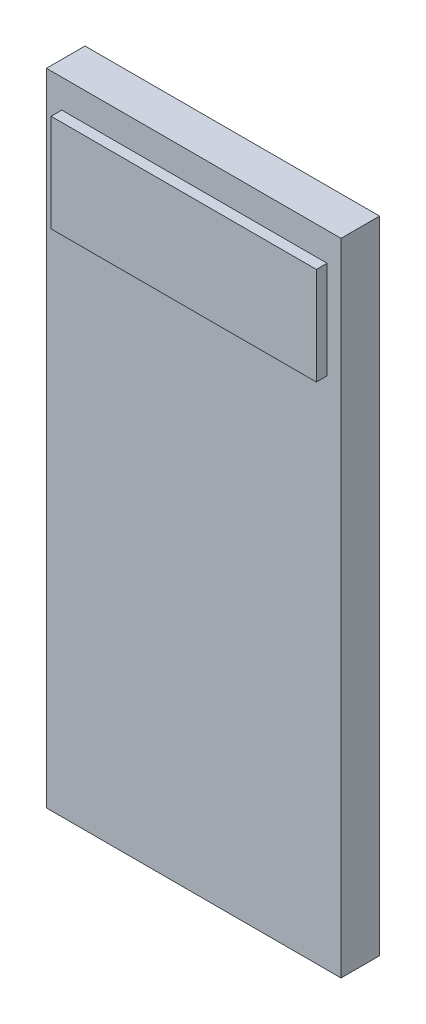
ISO-10303-21;
HEADER;
FILE_DESCRIPTION(('STEP AP214'),'2;1');
FILE_NAME('part.step','',(''),(''),'','','');
FILE_SCHEMA(('AUTOMOTIVE_DESIGN { 1 0 10303 214 1 1 1 1 }'));
ENDSEC;
DATA;
#1=APPLICATION_CONTEXT('core data for automotive mechanical design processes');
#2=APPLICATION_PROTOCOL_DEFINITION('international standard','automotive_design',2000,#1);
#3=PRODUCT_CONTEXT('',#1,'mechanical');
#4=PRODUCT('Part','Part','',(#3));
#5=PRODUCT_RELATED_PRODUCT_CATEGORY('part','',(#4));
#6=PRODUCT_DEFINITION_FORMATION('','',#4);
#7=PRODUCT_DEFINITION_CONTEXT('part definition',#1,'design');
#8=PRODUCT_DEFINITION('design','',#6,#7);
#9=PRODUCT_DEFINITION_SHAPE('','',#8);
#10=(LENGTH_UNIT() NAMED_UNIT(*) SI_UNIT(.MILLI.,.METRE.));
#11=(NAMED_UNIT(*) PLANE_ANGLE_UNIT() SI_UNIT($,.RADIAN.));
#12=(NAMED_UNIT(*) SI_UNIT($,.STERADIAN.) SOLID_ANGLE_UNIT());
#13=UNCERTAINTY_MEASURE_WITH_UNIT(LENGTH_MEASURE(1.E-05),#10,'distance_accuracy_value','');
#14=(GEOMETRIC_REPRESENTATION_CONTEXT(3) GLOBAL_UNCERTAINTY_ASSIGNED_CONTEXT((#13)) GLOBAL_UNIT_ASSIGNED_CONTEXT((#10,
#11,#12)) REPRESENTATION_CONTEXT('',''));
#15=CARTESIAN_POINT('',(0.,0.,0.));
#16=DIRECTION('',(0.,0.,1.));
#17=DIRECTION('',(1.,0.,0.));
#18=AXIS2_PLACEMENT_3D('',#15,#16,#17);
#19=CARTESIAN_POINT('',(10.7,0.,1.8));
#20=DIRECTION('',(0.,0.,-1.));
#21=DIRECTION('',(-1.,0.,0.));
#22=AXIS2_PLACEMENT_3D('',#19,#20,#21);
#23=PLANE('',#22);
#24=DIRECTION('',(0.,1.,0.));
#25=VECTOR('',#24,1.);
#26=CARTESIAN_POINT('',(-6.89999999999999,16.85,1.8));
#27=LINE('',#26,#25);
#28=CARTESIAN_POINT('',(-6.89999999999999,16.85,1.8));
#29=VERTEX_POINT('',#28);
#30=CARTESIAN_POINT('',(-6.89999999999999,46.75,1.8));
#31=VERTEX_POINT('',#30);
#32=EDGE_CURVE('E39',#29,#31,#27,.T.);
#33=ORIENTED_EDGE('',*,*,#32,.F.);
#34=DIRECTION('',(-1.,0.,0.));
#35=VECTOR('',#34,1.);
#36=CARTESIAN_POINT('',(6.84999999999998,16.85,1.8));
#37=LINE('',#36,#35);
#38=CARTESIAN_POINT('',(6.84999999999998,16.85,1.8));
#39=VERTEX_POINT('',#38);
#40=EDGE_CURVE('E126',#39,#29,#37,.T.);
#41=ORIENTED_EDGE('',*,*,#40,.F.);
#42=DIRECTION('',(0.,-1.,0.));
#43=VECTOR('',#42,1.);
#44=CARTESIAN_POINT('',(6.84999999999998,46.75,1.8));
#45=LINE('',#44,#43);
#46=CARTESIAN_POINT('',(6.84999999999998,46.75,1.8));
#47=VERTEX_POINT('',#46);
#48=EDGE_CURVE('E34',#47,#39,#45,.T.);
#49=ORIENTED_EDGE('',*,*,#48,.F.);
#50=DIRECTION('',(1.,0.,0.));
#51=VECTOR('',#50,1.);
#52=CARTESIAN_POINT('',(6.84999999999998,46.75,1.8));
#53=LINE('',#52,#51);
#54=EDGE_CURVE('E11',#31,#47,#53,.T.);
#55=ORIENTED_EDGE('',*,*,#54,.F.);
#56=EDGE_LOOP('',(#33,#41,#49,#55));
#57=FACE_BOUND('',#56,.T.);
#58=DIRECTION('',(0.,-1.,0.));
#59=VECTOR('',#58,1.);
#60=CARTESIAN_POINT('',(-6.1836979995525,45.4179345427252,1.8));
#61=LINE('',#60,#59);
#62=CARTESIAN_POINT('',(-6.1836979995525,45.4179345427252,1.8));
#63=VERTEX_POINT('',#62);
#64=CARTESIAN_POINT('',(-6.1836979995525,40.8666413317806,1.8));
#65=VERTEX_POINT('',#64);
#66=EDGE_CURVE('E93',#63,#65,#61,.T.);
#67=ORIENTED_EDGE('',*,*,#66,.F.);
#68=DIRECTION('',(-1.,0.,0.));
#69=VECTOR('',#68,1.);
#70=CARTESIAN_POINT('',(-6.1836979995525,45.4179345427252,1.8));
#71=LINE('',#70,#69);
#72=CARTESIAN_POINT('',(6.19953164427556,45.4179345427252,1.8));
#73=VERTEX_POINT('',#72);
#74=EDGE_CURVE('E95',#73,#63,#71,.T.);
#75=ORIENTED_EDGE('',*,*,#74,.F.);
#76=DIRECTION('',(0.,1.,0.));
#77=VECTOR('',#76,1.);
#78=CARTESIAN_POINT('',(6.19953164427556,45.4179345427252,1.8));
#79=LINE('',#78,#77);
#80=CARTESIAN_POINT('',(6.19953164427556,40.8666413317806,1.8));
#81=VERTEX_POINT('',#80);
#82=EDGE_CURVE('E52',#81,#73,#79,.T.);
#83=ORIENTED_EDGE('',*,*,#82,.F.);
#84=DIRECTION('',(1.,0.,0.));
#85=VECTOR('',#84,1.);
#86=CARTESIAN_POINT('',(-6.1836979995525,40.8666413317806,1.8));
#87=LINE('',#86,#85);
#88=EDGE_CURVE('E47',#65,#81,#87,.T.);
#89=ORIENTED_EDGE('',*,*,#88,.F.);
#90=EDGE_LOOP('',(#67,#75,#83,#89));
#91=FACE_BOUND('',#90,.T.);
#92=ADVANCED_FACE('F30',(#57,#91),#23,.F.);
#93=CARTESIAN_POINT('',(-6.89999999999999,46.75,0.));
#94=DIRECTION('',(0.,0.,-1.));
#95=DIRECTION('',(-1.,0.,0.));
#96=AXIS2_PLACEMENT_3D('',#93,#94,#95);
#97=PLANE('',#96);
#98=DIRECTION('',(-1.,0.,0.));
#99=VECTOR('',#98,1.);
#100=CARTESIAN_POINT('',(6.84999999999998,46.75,0.));
#101=LINE('',#100,#99);
#102=CARTESIAN_POINT('',(6.84999999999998,46.75,0.));
#103=VERTEX_POINT('',#102);
#104=CARTESIAN_POINT('',(-6.89999999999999,46.75,0.));
#105=VERTEX_POINT('',#104);
#106=EDGE_CURVE('E125',#103,#105,#101,.T.);
#107=ORIENTED_EDGE('',*,*,#106,.F.);
#108=DIRECTION('',(0.,1.,0.));
#109=VECTOR('',#108,1.);
#110=CARTESIAN_POINT('',(6.84999999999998,46.75,0.));
#111=LINE('',#110,#109);
#112=CARTESIAN_POINT('',(6.84999999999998,16.85,0.));
#113=VERTEX_POINT('',#112);
#114=EDGE_CURVE('E139',#113,#103,#111,.T.);
#115=ORIENTED_EDGE('',*,*,#114,.F.);
#116=DIRECTION('',(1.,0.,0.));
#117=VECTOR('',#116,1.);
#118=CARTESIAN_POINT('',(6.84999999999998,16.85,0.));
#119=LINE('',#118,#117);
#120=CARTESIAN_POINT('',(-6.89999999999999,16.85,0.));
#121=VERTEX_POINT('',#120);
#122=EDGE_CURVE('E136',#121,#113,#119,.T.);
#123=ORIENTED_EDGE('',*,*,#122,.F.);
#124=DIRECTION('',(0.,-1.,0.));
#125=VECTOR('',#124,1.);
#126=CARTESIAN_POINT('',(-6.89999999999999,16.85,0.));
#127=LINE('',#126,#125);
#128=EDGE_CURVE('E133',#105,#121,#127,.T.);
#129=ORIENTED_EDGE('',*,*,#128,.F.);
#130=EDGE_LOOP('',(#107,#115,#123,#129));
#131=FACE_BOUND('',#130,.T.);
#132=ADVANCED_FACE('F166',(#131),#97,.T.);
#133=CARTESIAN_POINT('',(6.84999999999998,46.75,34.7100668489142));
#134=DIRECTION('',(-1.,0.,0.));
#135=DIRECTION('',(0.,0.,1.));
#136=AXIS2_PLACEMENT_3D('',#133,#134,#135);
#137=PLANE('',#136);
#138=DIRECTION('',(0.,0.,-1.));
#139=VECTOR('',#138,1.);
#140=CARTESIAN_POINT('',(6.84999999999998,46.75,34.7100668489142));
#141=LINE('',#140,#139);
#142=EDGE_CURVE('E142',#47,#103,#141,.T.);
#143=ORIENTED_EDGE('',*,*,#142,.F.);
#144=ORIENTED_EDGE('',*,*,#48,.T.);
#145=DIRECTION('',(0.,0.,-1.));
#146=VECTOR('',#145,1.);
#147=CARTESIAN_POINT('',(6.84999999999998,16.85,34.7100668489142));
#148=LINE('',#147,#146);
#149=EDGE_CURVE('E144',#39,#113,#148,.T.);
#150=ORIENTED_EDGE('',*,*,#149,.T.);
#151=ORIENTED_EDGE('',*,*,#114,.T.);
#152=EDGE_LOOP('',(#143,#144,#150,#151));
#153=FACE_BOUND('',#152,.T.);
#154=ADVANCED_FACE('F154',(#153),#137,.F.);
#155=CARTESIAN_POINT('',(6.84999999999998,16.85,34.7100668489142));
#156=DIRECTION('',(0.,1.,0.));
#157=DIRECTION('',(0.,0.,1.));
#158=AXIS2_PLACEMENT_3D('',#155,#156,#157);
#159=PLANE('',#158);
#160=ORIENTED_EDGE('',*,*,#149,.F.);
#161=ORIENTED_EDGE('',*,*,#40,.T.);
#162=DIRECTION('',(0.,0.,-1.));
#163=VECTOR('',#162,1.);
#164=CARTESIAN_POINT('',(-6.89999999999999,16.85,34.7100668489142));
#165=LINE('',#164,#163);
#166=EDGE_CURVE('E146',#29,#121,#165,.T.);
#167=ORIENTED_EDGE('',*,*,#166,.T.);
#168=ORIENTED_EDGE('',*,*,#122,.T.);
#169=EDGE_LOOP('',(#160,#161,#167,#168));
#170=FACE_BOUND('',#169,.T.);
#171=ADVANCED_FACE('F163',(#170),#159,.F.);
#172=CARTESIAN_POINT('',(-6.89999999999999,16.85,34.7100668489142));
#173=DIRECTION('',(1.,0.,0.));
#174=DIRECTION('',(0.,0.,-1.));
#175=AXIS2_PLACEMENT_3D('',#172,#173,#174);
#176=PLANE('',#175);
#177=ORIENTED_EDGE('',*,*,#166,.F.);
#178=ORIENTED_EDGE('',*,*,#32,.T.);
#179=DIRECTION('',(0.,0.,-1.));
#180=VECTOR('',#179,1.);
#181=CARTESIAN_POINT('',(-6.89999999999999,46.75,34.7100668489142));
#182=LINE('',#181,#180);
#183=EDGE_CURVE('E147',#31,#105,#182,.T.);
#184=ORIENTED_EDGE('',*,*,#183,.T.);
#185=ORIENTED_EDGE('',*,*,#128,.T.);
#186=EDGE_LOOP('',(#177,#178,#184,#185));
#187=FACE_BOUND('',#186,.T.);
#188=ADVANCED_FACE('F160',(#187),#176,.F.);
#189=CARTESIAN_POINT('',(6.84999999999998,46.75,34.7100668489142));
#190=DIRECTION('',(0.,-1.,0.));
#191=DIRECTION('',(0.,0.,-1.));
#192=AXIS2_PLACEMENT_3D('',#189,#190,#191);
#193=PLANE('',#192);
#194=ORIENTED_EDGE('',*,*,#183,.F.);
#195=ORIENTED_EDGE('',*,*,#54,.T.);
#196=ORIENTED_EDGE('',*,*,#142,.T.);
#197=ORIENTED_EDGE('',*,*,#106,.T.);
#198=EDGE_LOOP('',(#194,#195,#196,#197));
#199=FACE_BOUND('',#198,.T.);
#200=ADVANCED_FACE('F32',(#199),#193,.F.);
#201=CARTESIAN_POINT('',(-6.1836979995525,45.4179345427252,2.3));
#202=DIRECTION('',(1.,0.,0.));
#203=DIRECTION('',(0.,0.,-1.));
#204=AXIS2_PLACEMENT_3D('',#201,#202,#203);
#205=PLANE('',#204);
#206=ORIENTED_EDGE('',*,*,#66,.T.);
#207=DIRECTION('',(0.,0.,-1.));
#208=VECTOR('',#207,1.);
#209=CARTESIAN_POINT('',(-6.1836979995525,40.8666413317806,2.3));
#210=LINE('',#209,#208);
#211=CARTESIAN_POINT('',(-6.1836979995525,40.8666413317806,2.3));
#212=VERTEX_POINT('',#211);
#213=EDGE_CURVE('E123',#212,#65,#210,.T.);
#214=ORIENTED_EDGE('',*,*,#213,.F.);
#215=DIRECTION('',(0.,-1.,0.));
#216=VECTOR('',#215,1.);
#217=CARTESIAN_POINT('',(-6.1836979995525,45.4179345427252,2.3));
#218=LINE('',#217,#216);
#219=CARTESIAN_POINT('',(-6.1836979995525,45.4179345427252,2.3));
#220=VERTEX_POINT('',#219);
#221=EDGE_CURVE('E109',#220,#212,#218,.T.);
#222=ORIENTED_EDGE('',*,*,#221,.F.);
#223=DIRECTION('',(0.,0.,-1.));
#224=VECTOR('',#223,1.);
#225=CARTESIAN_POINT('',(-6.1836979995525,45.4179345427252,2.3));
#226=LINE('',#225,#224);
#227=EDGE_CURVE('E105',#220,#63,#226,.T.);
#228=ORIENTED_EDGE('',*,*,#227,.T.);
#229=EDGE_LOOP('',(#206,#214,#222,#228));
#230=FACE_BOUND('',#229,.T.);
#231=ADVANCED_FACE('F111',(#230),#205,.F.);
#232=CARTESIAN_POINT('',(-6.1836979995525,40.8666413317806,2.3));
#233=DIRECTION('',(0.,1.,0.));
#234=DIRECTION('',(0.,0.,1.));
#235=AXIS2_PLACEMENT_3D('',#232,#233,#234);
#236=PLANE('',#235);
#237=ORIENTED_EDGE('',*,*,#88,.T.);
#238=DIRECTION('',(0.,0.,-1.));
#239=VECTOR('',#238,1.);
#240=CARTESIAN_POINT('',(6.19953164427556,40.8666413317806,2.3));
#241=LINE('',#240,#239);
#242=CARTESIAN_POINT('',(6.19953164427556,40.8666413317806,2.3));
#243=VERTEX_POINT('',#242);
#244=EDGE_CURVE('E115',#243,#81,#241,.T.);
#245=ORIENTED_EDGE('',*,*,#244,.F.);
#246=DIRECTION('',(1.,0.,0.));
#247=VECTOR('',#246,1.);
#248=CARTESIAN_POINT('',(-6.1836979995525,40.8666413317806,2.3));
#249=LINE('',#248,#247);
#250=EDGE_CURVE('E203',#212,#243,#249,.T.);
#251=ORIENTED_EDGE('',*,*,#250,.F.);
#252=ORIENTED_EDGE('',*,*,#213,.T.);
#253=EDGE_LOOP('',(#237,#245,#251,#252));
#254=FACE_BOUND('',#253,.T.);
#255=ADVANCED_FACE('F185',(#254),#236,.F.);
#256=CARTESIAN_POINT('',(6.19953164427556,45.4179345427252,2.3));
#257=DIRECTION('',(-1.,0.,0.));
#258=DIRECTION('',(0.,0.,1.));
#259=AXIS2_PLACEMENT_3D('',#256,#257,#258);
#260=PLANE('',#259);
#261=ORIENTED_EDGE('',*,*,#82,.T.);
#262=DIRECTION('',(0.,0.,-1.));
#263=VECTOR('',#262,1.);
#264=CARTESIAN_POINT('',(6.19953164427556,45.4179345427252,2.3));
#265=LINE('',#264,#263);
#266=CARTESIAN_POINT('',(6.19953164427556,45.4179345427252,2.3));
#267=VERTEX_POINT('',#266);
#268=EDGE_CURVE('E108',#267,#73,#265,.T.);
#269=ORIENTED_EDGE('',*,*,#268,.F.);
#270=DIRECTION('',(0.,1.,0.));
#271=VECTOR('',#270,1.);
#272=CARTESIAN_POINT('',(6.19953164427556,45.4179345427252,2.3));
#273=LINE('',#272,#271);
#274=EDGE_CURVE('E117',#243,#267,#273,.T.);
#275=ORIENTED_EDGE('',*,*,#274,.F.);
#276=ORIENTED_EDGE('',*,*,#244,.T.);
#277=EDGE_LOOP('',(#261,#269,#275,#276));
#278=FACE_BOUND('',#277,.T.);
#279=ADVANCED_FACE('F189',(#278),#260,.F.);
#280=CARTESIAN_POINT('',(-6.1836979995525,45.4179345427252,2.3));
#281=DIRECTION('',(0.,-1.,0.));
#282=DIRECTION('',(0.,0.,-1.));
#283=AXIS2_PLACEMENT_3D('',#280,#281,#282);
#284=PLANE('',#283);
#285=ORIENTED_EDGE('',*,*,#74,.T.);
#286=ORIENTED_EDGE('',*,*,#227,.F.);
#287=DIRECTION('',(-1.,0.,0.));
#288=VECTOR('',#287,1.);
#289=CARTESIAN_POINT('',(-6.1836979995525,45.4179345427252,2.3));
#290=LINE('',#289,#288);
#291=EDGE_CURVE('E113',#267,#220,#290,.T.);
#292=ORIENTED_EDGE('',*,*,#291,.F.);
#293=ORIENTED_EDGE('',*,*,#268,.T.);
#294=EDGE_LOOP('',(#285,#286,#292,#293));
#295=FACE_BOUND('',#294,.T.);
#296=ADVANCED_FACE('F103',(#295),#284,.F.);
#297=CARTESIAN_POINT('',(-6.1836979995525,40.8666413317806,2.3));
#298=DIRECTION('',(0.,0.,1.));
#299=DIRECTION('',(1.,0.,0.));
#300=AXIS2_PLACEMENT_3D('',#297,#298,#299);
#301=PLANE('',#300);
#302=ORIENTED_EDGE('',*,*,#221,.T.);
#303=ORIENTED_EDGE('',*,*,#250,.T.);
#304=ORIENTED_EDGE('',*,*,#274,.T.);
#305=ORIENTED_EDGE('',*,*,#291,.T.);
#306=EDGE_LOOP('',(#302,#303,#304,#305));
#307=FACE_BOUND('',#306,.T.);
#308=ADVANCED_FACE('F198',(#307),#301,.T.);
#309=CLOSED_SHELL('',(#92,#132,#154,#171,#188,#200,#231,#255,#279,#296,#308));
#310=MANIFOLD_SOLID_BREP('B2',#309);
#311=ADVANCED_BREP_SHAPE_REPRESENTATION('',(#18,#310),#14);
#312=SHAPE_DEFINITION_REPRESENTATION(#9,#311);
ENDSEC;
END-ISO-10303-21;
